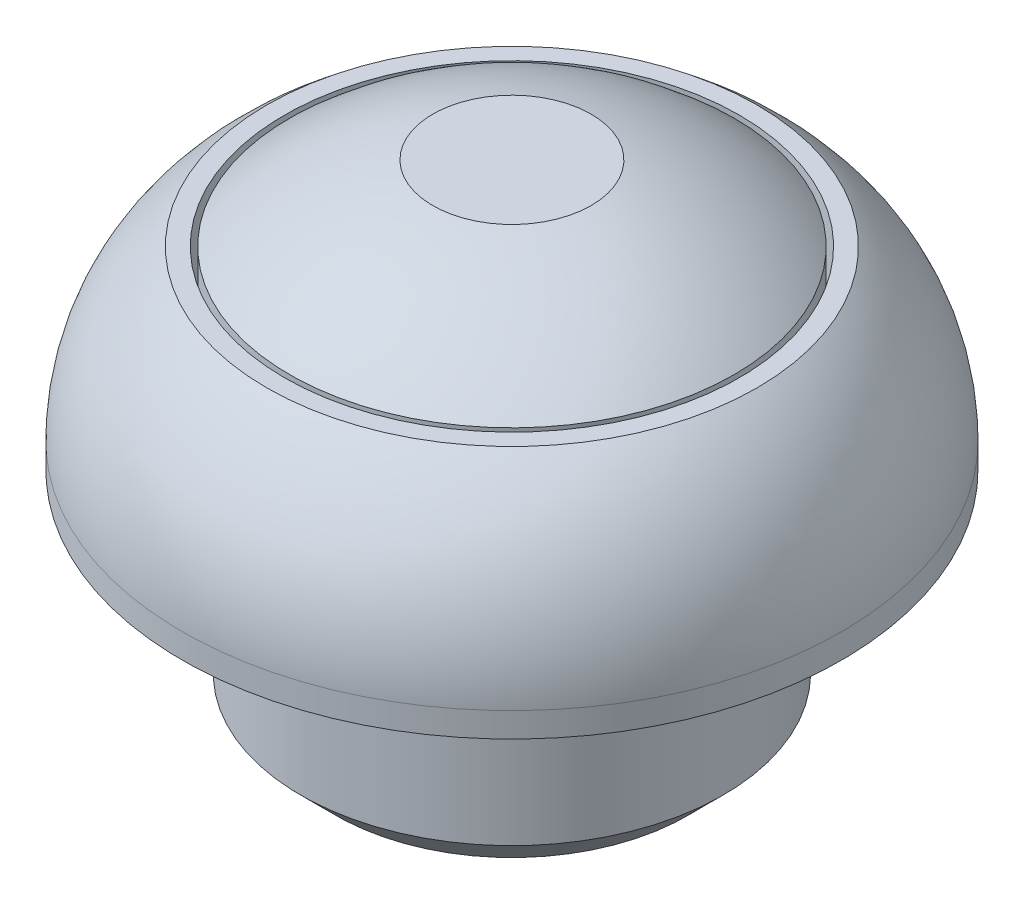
ISO-10303-21;
HEADER;
FILE_DESCRIPTION(('STEP AP214'),'2;1');
FILE_NAME('part.step','',(''),(''),'','','');
FILE_SCHEMA(('AUTOMOTIVE_DESIGN { 1 0 10303 214 1 1 1 1 }'));
ENDSEC;
DATA;
#1=APPLICATION_CONTEXT('core data for automotive mechanical design processes');
#2=APPLICATION_PROTOCOL_DEFINITION('international standard','automotive_design',2000,#1);
#3=PRODUCT_CONTEXT('',#1,'mechanical');
#4=PRODUCT('Part','Part','',(#3));
#5=PRODUCT_RELATED_PRODUCT_CATEGORY('part','',(#4));
#6=PRODUCT_DEFINITION_FORMATION('','',#4);
#7=PRODUCT_DEFINITION_CONTEXT('part definition',#1,'design');
#8=PRODUCT_DEFINITION('design','',#6,#7);
#9=PRODUCT_DEFINITION_SHAPE('','',#8);
#10=(LENGTH_UNIT() NAMED_UNIT(*) SI_UNIT(.MILLI.,.METRE.));
#11=(NAMED_UNIT(*) PLANE_ANGLE_UNIT() SI_UNIT($,.RADIAN.));
#12=(NAMED_UNIT(*) SI_UNIT($,.STERADIAN.) SOLID_ANGLE_UNIT());
#13=UNCERTAINTY_MEASURE_WITH_UNIT(LENGTH_MEASURE(1.E-05),#10,'distance_accuracy_value','');
#14=(GEOMETRIC_REPRESENTATION_CONTEXT(3) GLOBAL_UNCERTAINTY_ASSIGNED_CONTEXT((#13)) GLOBAL_UNIT_ASSIGNED_CONTEXT((#10,
#11,#12)) REPRESENTATION_CONTEXT('',''));
#15=CARTESIAN_POINT('',(0.,0.,0.));
#16=DIRECTION('',(0.,0.,1.));
#17=DIRECTION('',(1.,0.,0.));
#18=AXIS2_PLACEMENT_3D('',#15,#16,#17);
#19=CARTESIAN_POINT('',(0.,7.5,0.));
#20=DIRECTION('',(0.,-1.,0.));
#21=DIRECTION('',(0.,0.,-1.));
#22=AXIS2_PLACEMENT_3D('',#19,#20,#21);
#23=PLANE('',#22);
#24=CARTESIAN_POINT('',(0.,7.5,0.));
#25=DIRECTION('',(0.,-1.,0.));
#26=DIRECTION('',(0.,0.,-1.));
#27=AXIS2_PLACEMENT_3D('',#24,#25,#26);
#28=CIRCLE('',#27,6.3118935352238);
#29=CARTESIAN_POINT('',(0.,7.5,-6.3118935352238));
#30=VERTEX_POINT('',#29);
#31=EDGE_CURVE('E11',#30,#30,#28,.T.);
#32=ORIENTED_EDGE('',*,*,#31,.T.);
#33=EDGE_LOOP('',(#32));
#34=FACE_BOUND('',#33,.T.);
#35=ADVANCED_FACE('F49',(#34),#23,.T.);
#36=CARTESIAN_POINT('',(0.,0.,0.));
#37=DIRECTION('',(0.,-1.,0.));
#38=DIRECTION('',(0.,0.,-1.));
#39=AXIS2_PLACEMENT_3D('',#36,#37,#38);
#40=CYLINDRICAL_SURFACE('',#39,6.3118935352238);
#41=CARTESIAN_POINT('',(0.,11.5,0.));
#42=DIRECTION('',(0.,-1.,0.));
#43=DIRECTION('',(0.,0.,-1.));
#44=AXIS2_PLACEMENT_3D('',#41,#42,#43);
#45=CIRCLE('',#44,6.3118935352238);
#46=CARTESIAN_POINT('',(6.31189353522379,11.5,0.));
#47=VERTEX_POINT('',#46);
#48=EDGE_CURVE('E55',#47,#47,#45,.T.);
#49=ORIENTED_EDGE('',*,*,#48,.T.);
#50=EDGE_LOOP('',(#49));
#51=FACE_BOUND('',#50,.T.);
#52=ORIENTED_EDGE('',*,*,#31,.F.);
#53=EDGE_LOOP('',(#52));
#54=FACE_BOUND('',#53,.T.);
#55=ADVANCED_FACE('F75',(#51,#54),#40,.T.);
#56=CARTESIAN_POINT('',(0.,4.4,0.));
#57=DIRECTION('',(0.,-1.,0.));
#58=DIRECTION('',(1.,0.,0.));
#59=AXIS2_PLACEMENT_3D('',#56,#57,#58);
#60=SPHERICAL_SURFACE('',#59,9.5);
#61=CARTESIAN_POINT('',(0.,13.6297074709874,0.));
#62=DIRECTION('',(0.,-1.,0.));
#63=DIRECTION('',(0.,0.,-1.));
#64=AXIS2_PLACEMENT_3D('',#61,#62,#63);
#65=CIRCLE('',#64,2.25);
#66=CARTESIAN_POINT('',(2.24999999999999,13.6297074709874,0.));
#67=VERTEX_POINT('',#66);
#68=EDGE_CURVE('E59',#67,#67,#65,.T.);
#69=CARTESIAN_POINT('',(2.24999999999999,13.6297074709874,0.));
#70=CARTESIAN_POINT('',(2.2968782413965,13.6182796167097,0.));
#71=CARTESIAN_POINT('',(2.34366940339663,13.6064945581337,0.));
#72=CARTESIAN_POINT('',(2.43706673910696,13.5822128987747,0.));
#73=CARTESIAN_POINT('',(2.48367291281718,13.5697162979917,0.));
#74=CARTESIAN_POINT('',(2.57668944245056,13.5440144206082,0.));
#75=CARTESIAN_POINT('',(2.62309979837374,13.5308091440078,0.));
#76=CARTESIAN_POINT('',(2.71571391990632,13.5036929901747,0.));
#77=CARTESIAN_POINT('',(2.76191768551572,13.489782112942,0.));
#78=CARTESIAN_POINT('',(2.85410789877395,13.4612579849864,0.));
#79=CARTESIAN_POINT('',(2.90009434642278,13.4466447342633,0.));
#80=CARTESIAN_POINT('',(2.99183924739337,13.4167192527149,0.));
#81=CARTESIAN_POINT('',(3.03759770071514,13.4014070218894,0.));
#82=CARTESIAN_POINT('',(3.12887598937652,13.3700871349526,0.));
#83=CARTESIAN_POINT('',(3.17439582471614,13.3540794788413,0.));
#84=CARTESIAN_POINT('',(3.26518630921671,13.3213724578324,0.));
#85=CARTESIAN_POINT('',(3.31045695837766,13.3046730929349,0.));
#86=CARTESIAN_POINT('',(3.40073856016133,13.270586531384,0.));
#87=CARTESIAN_POINT('',(3.44574951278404,13.2531993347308,0.));
#88=CARTESIAN_POINT('',(3.53550127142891,13.2177411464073,0.));
#89=CARTESIAN_POINT('',(3.58024207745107,13.1996701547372,0.));
#90=CARTESIAN_POINT('',(3.66944315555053,13.1628485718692,0.));
#91=CARTESIAN_POINT('',(3.71390342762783,13.1440979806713,0.));
#92=CARTESIAN_POINT('',(3.80253311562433,13.1059215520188,0.));
#93=CARTESIAN_POINT('',(3.84670253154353,13.0864957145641,0.));
#94=CARTESIAN_POINT('',(3.93474025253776,13.0469733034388,0.));
#95=CARTESIAN_POINT('',(3.97860855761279,13.0268767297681,0.));
#96=CARTESIAN_POINT('',(4.06603387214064,12.9860175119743,0.));
#97=CARTESIAN_POINT('',(4.10959088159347,12.9652548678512,0.));
#98=CARTESIAN_POINT('',(4.19638349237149,12.9230683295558,0.));
#99=CARTESIAN_POINT('',(4.23961909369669,12.9016444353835,0.));
#100=CARTESIAN_POINT('',(4.32575885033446,12.8581403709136,0.));
#101=CARTESIAN_POINT('',(4.36866300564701,12.8360602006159,0.));
#102=CARTESIAN_POINT('',(4.45412990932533,12.7912487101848,0.));
#103=CARTESIAN_POINT('',(4.49669265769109,12.7685173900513,0.));
#104=CARTESIAN_POINT('',(4.58146686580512,12.7224088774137,0.));
#105=CARTESIAN_POINT('',(4.6236783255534,12.6990316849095,0.));
#106=CARTESIAN_POINT('',(4.70774015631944,12.6516368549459,0.));
#107=CARTESIAN_POINT('',(4.7495905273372,12.6276192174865,0.));
#108=CARTESIAN_POINT('',(4.83292046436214,12.5789490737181,0.));
#109=CARTESIAN_POINT('',(4.87440003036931,12.5542965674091,0.));
#110=CARTESIAN_POINT('',(4.95697872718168,12.504362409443,0.));
#111=CARTESIAN_POINT('',(4.99807785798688,12.4790807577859,0.));
#112=CARTESIAN_POINT('',(5.07988614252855,12.4278941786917,0.));
#113=CARTESIAN_POINT('',(5.12059529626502,12.4019892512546,0.));
#114=CARTESIAN_POINT('',(5.20161417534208,12.3495621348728,0.));
#115=CARTESIAN_POINT('',(5.24192390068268,12.3230399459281,0.));
#116=CARTESIAN_POINT('',(5.32213456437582,12.2693844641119,0.));
#117=CARTESIAN_POINT('',(5.36203550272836,12.2422511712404,0.));
#118=CARTESIAN_POINT('',(5.44141932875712,12.1873797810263,0.));
#119=CARTESIAN_POINT('',(5.48090221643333,12.1596416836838,0.));
#120=CARTESIAN_POINT('',(5.55944077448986,12.103567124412,0.));
#121=CARTESIAN_POINT('',(5.59849644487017,12.0752306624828,0.));
#122=CARTESIAN_POINT('',(5.67617150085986,12.0179659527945,0.));
#123=CARTESIAN_POINT('',(5.71479088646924,11.9890377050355,0.));
#124=CARTESIAN_POINT('',(5.79158440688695,11.9305961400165,0.));
#125=CARTESIAN_POINT('',(5.82975854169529,11.9010828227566,0.));
#126=CARTESIAN_POINT('',(5.90565269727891,11.841477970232,0.));
#127=CARTESIAN_POINT('',(5.94337271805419,11.8113864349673,0.));
#128=CARTESIAN_POINT('',(6.0183498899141,11.7506321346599,0.));
#129=CARTESIAN_POINT('',(6.05560704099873,11.7199693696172,0.));
#130=CARTESIAN_POINT('',(6.12964981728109,11.658079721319,0.));
#131=CARTESIAN_POINT('',(6.16643544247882,11.6268528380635,0.));
#132=CARTESIAN_POINT('',(6.23952665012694,11.5638422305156,0.));
#133=CARTESIAN_POINT('',(6.27583223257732,11.5320585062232,0.));
#134=CARTESIAN_POINT('',(6.31189353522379,11.5,0.));
#135=B_SPLINE_CURVE_WITH_KNOTS('',3,(#69,#70,#71,#72,#73,#74,#75,#76,#77,#78,#79,#80,#81,#82,
#83,#84,#85,#86,#87,#88,#89,#90,#91,#92,#93,#94,#95,#96,#97,#98,#99,#100,#101,#102,#103,#104,
#105,#106,#107,#108,#109,#110,#111,#112,#113,#114,#115,#116,#117,#118,#119,#120,#121,#122,#123,
#124,#125,#126,#127,#128,#129,#130,#131,#132,#133,#134),.UNSPECIFIED.,.F.,.F.,(4,2,2,2,2,2,2,2,
2,2,2,2,2,2,2,2,2,2,2,2,2,2,2,2,2,2,2,2,2,2,2,2,4),(0.,0.144751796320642,0.289503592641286,
0.434255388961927,0.579007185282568,0.723758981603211,0.868510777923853,1.01326257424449,
1.15801437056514,1.30276616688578,1.44751796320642,1.59226975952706,1.73702155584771,
1.88177335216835,2.02652514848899,2.17127694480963,2.31602874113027,2.46078053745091,
2.60553233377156,2.7502841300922,2.89503592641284,3.03978772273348,3.18453951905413,
3.32929131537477,3.47404311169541,3.61879490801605,3.76354670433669,3.90829850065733,
4.05305029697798,4.19780209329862,4.34255388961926,4.4873056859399,4.63205748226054),.UNSPECIFIED.);
#136=EDGE_CURVE('BSEAM66',#67,#47,#135,.T.);
#137=ORIENTED_EDGE('',*,*,#68,.T.);
#138=ORIENTED_EDGE('',*,*,#48,.F.);
#139=ORIENTED_EDGE('',*,*,#136,.T.);
#140=ORIENTED_EDGE('',*,*,#136,.F.);
#141=EDGE_LOOP('',(#137,#139,#138,#140));
#142=FACE_BOUND('',#141,.T.);
#143=ADVANCED_FACE('F66',(#142),#60,.T.);
#144=CARTESIAN_POINT('',(2.25,13.6297074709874,0.));
#145=DIRECTION('',(0.,1.,0.));
#146=DIRECTION('',(0.,0.,1.));
#147=AXIS2_PLACEMENT_3D('',#144,#145,#146);
#148=PLANE('',#147);
#149=ORIENTED_EDGE('',*,*,#68,.F.);
#150=EDGE_LOOP('',(#149));
#151=FACE_BOUND('',#150,.T.);
#152=ADVANCED_FACE('F69',(#151),#148,.T.);
#153=CLOSED_SHELL('',(#35,#55,#143,#152));
#154=MANIFOLD_SOLID_BREP('B2',#153);
#155=CARTESIAN_POINT('',(0.,0.,0.));
#156=DIRECTION('',(0.,-1.,0.));
#157=DIRECTION('',(0.,0.,-1.));
#158=AXIS2_PLACEMENT_3D('',#155,#156,#157);
#159=PLANE('',#158);
#160=CARTESIAN_POINT('',(0.,0.,0.));
#161=DIRECTION('',(0.,-1.,0.));
#162=DIRECTION('',(0.,0.,-1.));
#163=AXIS2_PLACEMENT_3D('',#160,#161,#162);
#164=CIRCLE('',#163,4.99999999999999);
#165=CARTESIAN_POINT('',(0.,0.,-4.99999999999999));
#166=VERTEX_POINT('',#165);
#167=EDGE_CURVE('E113',#166,#166,#164,.T.);
#168=ORIENTED_EDGE('',*,*,#167,.T.);
#169=EDGE_LOOP('',(#168));
#170=FACE_BOUND('',#169,.T.);
#171=ADVANCED_FACE('F105',(#170),#159,.T.);
#172=CARTESIAN_POINT('',(0.,6.7,0.));
#173=DIRECTION('',(0.,1.,0.));
#174=DIRECTION('',(0.,0.,1.));
#175=AXIS2_PLACEMENT_3D('',#172,#173,#174);
#176=PLANE('',#175);
#177=CARTESIAN_POINT('',(0.,6.7,0.));
#178=DIRECTION('',(0.,-1.,0.));
#179=DIRECTION('',(0.,0.,-1.));
#180=AXIS2_PLACEMENT_3D('',#177,#178,#179);
#181=CIRCLE('',#180,6.4618935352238);
#182=CARTESIAN_POINT('',(0.,6.7,-6.4618935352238));
#183=VERTEX_POINT('',#182);
#184=EDGE_CURVE('E117',#183,#183,#181,.T.);
#185=ORIENTED_EDGE('',*,*,#184,.F.);
#186=EDGE_LOOP('',(#185));
#187=FACE_BOUND('',#186,.T.);
#188=ADVANCED_FACE('F155',(#187),#176,.T.);
#189=CARTESIAN_POINT('',(0.,0.,0.));
#190=DIRECTION('',(0.,-1.,0.));
#191=DIRECTION('',(0.,0.,-1.));
#192=AXIS2_PLACEMENT_3D('',#189,#190,#191);
#193=CYLINDRICAL_SURFACE('',#192,6.4618935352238);
#194=ORIENTED_EDGE('',*,*,#184,.T.);
#195=EDGE_LOOP('',(#194));
#196=FACE_BOUND('',#195,.T.);
#197=CARTESIAN_POINT('',(0.,11.5,0.));
#198=DIRECTION('',(0.,-1.,0.));
#199=DIRECTION('',(0.,0.,-1.));
#200=AXIS2_PLACEMENT_3D('',#197,#198,#199);
#201=CIRCLE('',#200,6.4618935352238);
#202=CARTESIAN_POINT('',(0.,11.5,-6.4618935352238));
#203=VERTEX_POINT('',#202);
#204=EDGE_CURVE('E121',#203,#203,#201,.T.);
#205=ORIENTED_EDGE('',*,*,#204,.F.);
#206=EDGE_LOOP('',(#205));
#207=FACE_BOUND('',#206,.T.);
#208=ADVANCED_FACE('F159',(#196,#207),#193,.F.);
#209=CARTESIAN_POINT('',(6.4618935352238,11.5,0.));
#210=DIRECTION('',(0.,1.,0.));
#211=DIRECTION('',(0.,0.,1.));
#212=AXIS2_PLACEMENT_3D('',#209,#210,#211);
#213=PLANE('',#212);
#214=ORIENTED_EDGE('',*,*,#204,.T.);
#215=EDGE_LOOP('',(#214));
#216=FACE_BOUND('',#215,.T.);
#217=CARTESIAN_POINT('',(0.,11.5,0.));
#218=DIRECTION('',(0.,-1.,0.));
#219=DIRECTION('',(0.,0.,-1.));
#220=AXIS2_PLACEMENT_3D('',#217,#218,#219);
#221=CIRCLE('',#220,6.9618935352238);
#222=CARTESIAN_POINT('',(0.,11.5,-6.9618935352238));
#223=VERTEX_POINT('',#222);
#224=EDGE_CURVE('E126',#223,#223,#221,.T.);
#225=ORIENTED_EDGE('',*,*,#224,.F.);
#226=EDGE_LOOP('',(#225));
#227=FACE_BOUND('',#226,.T.);
#228=ADVANCED_FACE('F165',(#216,#227),#213,.T.);
#229=CARTESIAN_POINT('',(0.,6.7,0.));
#230=DIRECTION('',(0.,-1.,0.));
#231=DIRECTION('',(0.,0.,-1.));
#232=AXIS2_PLACEMENT_3D('',#229,#230,#231);
#233=DEGENERATE_TOROIDAL_SURFACE('',#232,3.3618935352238,6.,.T.);
#234=ORIENTED_EDGE('',*,*,#224,.T.);
#235=EDGE_LOOP('',(#234));
#236=FACE_BOUND('',#235,.T.);
#237=CARTESIAN_POINT('',(0.,6.7,0.));
#238=DIRECTION('',(0.,-1.,0.));
#239=DIRECTION('',(0.,0.,-1.));
#240=AXIS2_PLACEMENT_3D('',#237,#238,#239);
#241=CIRCLE('',#240,9.3618935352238);
#242=CARTESIAN_POINT('',(0.,6.7,-9.3618935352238));
#243=VERTEX_POINT('',#242);
#244=EDGE_CURVE('E129',#243,#243,#241,.T.);
#245=ORIENTED_EDGE('',*,*,#244,.F.);
#246=EDGE_LOOP('',(#245));
#247=FACE_BOUND('',#246,.T.);
#248=ADVANCED_FACE('F152',(#236,#247),#233,.T.);
#249=CARTESIAN_POINT('',(0.,0.,0.));
#250=DIRECTION('',(0.,-1.,0.));
#251=DIRECTION('',(0.,0.,-1.));
#252=AXIS2_PLACEMENT_3D('',#249,#250,#251);
#253=CYLINDRICAL_SURFACE('',#252,9.3618935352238);
#254=ORIENTED_EDGE('',*,*,#244,.T.);
#255=EDGE_LOOP('',(#254));
#256=FACE_BOUND('',#255,.T.);
#257=CARTESIAN_POINT('',(0.,6.,0.));
#258=DIRECTION('',(0.,-1.,0.));
#259=DIRECTION('',(0.,0.,-1.));
#260=AXIS2_PLACEMENT_3D('',#257,#258,#259);
#261=CIRCLE('',#260,9.3618935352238);
#262=CARTESIAN_POINT('',(0.,6.,-9.3618935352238));
#263=VERTEX_POINT('',#262);
#264=EDGE_CURVE('E132',#263,#263,#261,.T.);
#265=ORIENTED_EDGE('',*,*,#264,.F.);
#266=EDGE_LOOP('',(#265));
#267=FACE_BOUND('',#266,.T.);
#268=ADVANCED_FACE('F143',(#256,#267),#253,.T.);
#269=CARTESIAN_POINT('',(6.,6.,0.));
#270=DIRECTION('',(0.,-1.,0.));
#271=DIRECTION('',(0.,0.,-1.));
#272=AXIS2_PLACEMENT_3D('',#269,#270,#271);
#273=PLANE('',#272);
#274=ORIENTED_EDGE('',*,*,#264,.T.);
#275=EDGE_LOOP('',(#274));
#276=FACE_BOUND('',#275,.T.);
#277=CARTESIAN_POINT('',(0.,6.,0.));
#278=DIRECTION('',(0.,-1.,0.));
#279=DIRECTION('',(0.,0.,-1.));
#280=AXIS2_PLACEMENT_3D('',#277,#278,#279);
#281=CIRCLE('',#280,6.);
#282=CARTESIAN_POINT('',(0.,6.,-6.));
#283=VERTEX_POINT('',#282);
#284=EDGE_CURVE('E135',#283,#283,#281,.T.);
#285=ORIENTED_EDGE('',*,*,#284,.F.);
#286=EDGE_LOOP('',(#285));
#287=FACE_BOUND('',#286,.T.);
#288=ADVANCED_FACE('F141',(#276,#287),#273,.T.);
#289=CARTESIAN_POINT('',(0.,0.,0.));
#290=DIRECTION('',(0.,-1.,0.));
#291=DIRECTION('',(0.,0.,-1.));
#292=AXIS2_PLACEMENT_3D('',#289,#290,#291);
#293=CYLINDRICAL_SURFACE('',#292,6.);
#294=CARTESIAN_POINT('',(0.,1.00000000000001,0.));
#295=DIRECTION('',(0.,-1.,0.));
#296=DIRECTION('',(0.,0.,-1.));
#297=AXIS2_PLACEMENT_3D('',#294,#295,#296);
#298=CIRCLE('',#297,6.);
#299=CARTESIAN_POINT('',(0.,1.00000000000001,-6.));
#300=VERTEX_POINT('',#299);
#301=EDGE_CURVE('E48',#300,#300,#298,.F.);
#302=ORIENTED_EDGE('',*,*,#301,.T.);
#303=EDGE_LOOP('',(#302));
#304=FACE_BOUND('',#303,.T.);
#305=ORIENTED_EDGE('',*,*,#284,.T.);
#306=EDGE_LOOP('',(#305));
#307=FACE_BOUND('',#306,.T.);
#308=ADVANCED_FACE('F139',(#304,#307),#293,.T.);
#309=CARTESIAN_POINT('',(0.,0.,0.));
#310=DIRECTION('',(0.,1.,0.));
#311=DIRECTION('',(0.,0.,1.));
#312=AXIS2_PLACEMENT_3D('',#309,#310,#311);
#313=CONICAL_SURFACE('',#312,4.99999999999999,0.785398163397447);
#314=ORIENTED_EDGE('',*,*,#301,.F.);
#315=EDGE_LOOP('',(#314));
#316=FACE_BOUND('',#315,.T.);
#317=ORIENTED_EDGE('',*,*,#167,.F.);
#318=EDGE_LOOP('',(#317));
#319=FACE_BOUND('',#318,.T.);
#320=ADVANCED_FACE('F108',(#316,#319),#313,.T.);
#321=CLOSED_SHELL('',(#171,#188,#208,#228,#248,#268,#288,#308,#320));
#322=MANIFOLD_SOLID_BREP('B6',#321);
#323=ADVANCED_BREP_SHAPE_REPRESENTATION('',(#18,#154,#322),#14);
#324=SHAPE_DEFINITION_REPRESENTATION(#9,#323);
ENDSEC;
END-ISO-10303-21;
